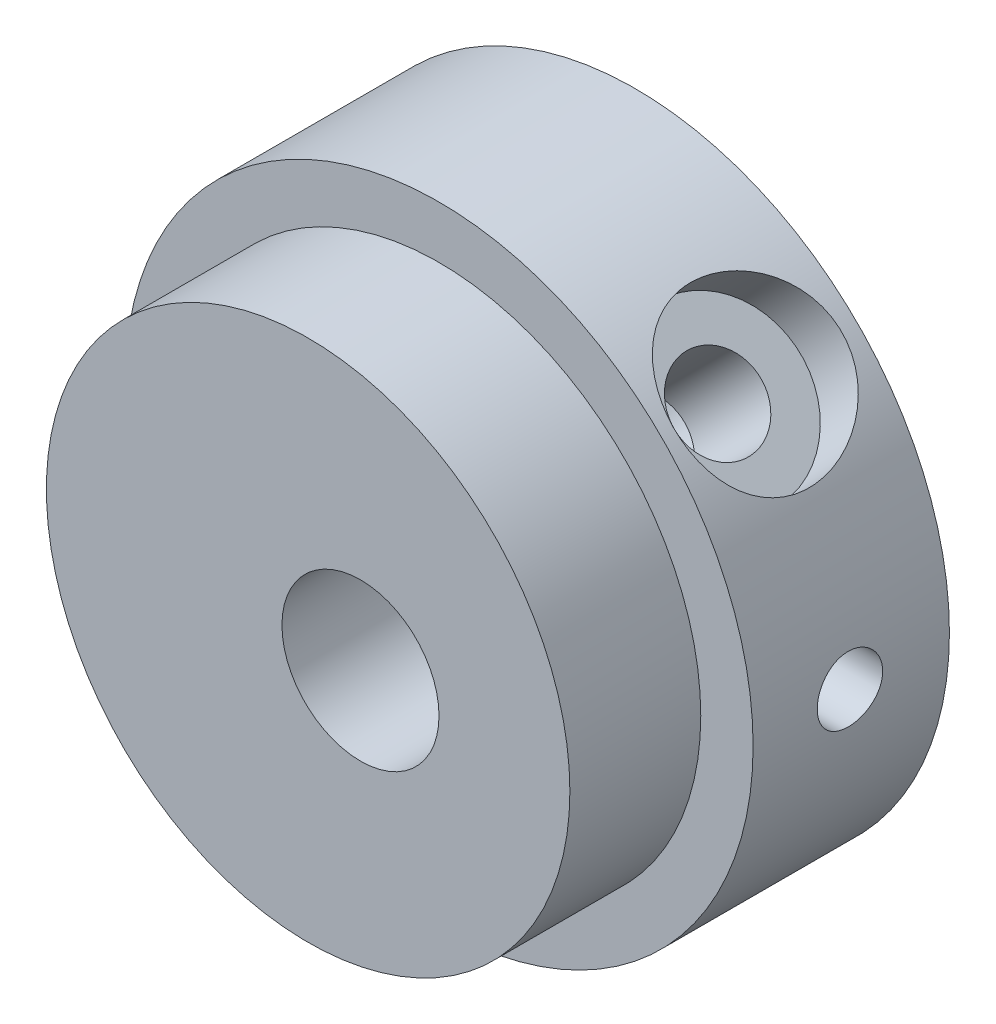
from build123d import *

# Parameters (mm, degrees)
SKETCH1_R                                          = 30.48
BOSS_EXTRUDE1_DEPTH                                = 19.05
SKETCH2_R                                          = 25.4
BOSS_EXTRUDE2_DEPTH                                = 12.7
SKETCH3_R                                          = 7.62
CUT_EXTRUDE1_DEPTH                                 = 47.752
SKETCH4_R                                          = 3.175
CUT_EXTRUDE2_DEPTH                                 = 47.752
CBORE_FOR_5_16_PAN_HEAD_MACHINE_SCREW1_D           = 8.4328
CBORE_FOR_5_16_PAN_HEAD_MACHINE_SCREW1_DEPTH       = 16.002
CBORE_FOR_5_16_PAN_HEAD_MACHINE_SCREW1_CBORE_D     = 16.27124
CBORE_FOR_5_16_PAN_HEAD_MACHINE_SCREW1_CBORE_DEPTH = 5.5372
CBORE_FOR_5_16_PAN_HEAD_MACHINE_SCREW1_TIP         = 2.533468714


with BuildPart() as part:
    # Sketch1 → Boss-Extrude1 (new body)
    with BuildSketch(Plane.XY):
        with Locations(Location((0, 0, 0), (0, 0, 180))):
            Circle(SKETCH1_R)
    extrude(amount=BOSS_EXTRUDE1_DEPTH)

    # Sketch2 → Boss-Extrude2 (add)
    with BuildSketch(Plane.XY.offset(19.05)):
        Circle(SKETCH2_R)
    extrude(amount=BOSS_EXTRUDE2_DEPTH)

    # Sketch3 → Cut-Extrude1 (cut)
    with BuildSketch(Plane(origin=(0, 0, 0), x_dir=(-1, 0, 0), z_dir=(0, 0, -1))):
        with Locations((-5.08, 0)):
            Circle(SKETCH3_R)
    extrude(amount=-CUT_EXTRUDE1_DEPTH, mode=Mode.SUBTRACT)

    # Sketch4 → Cut-Extrude2 (cut)
    with BuildSketch(Plane(origin=(0, 0, 0), x_dir=(0, 0, -1), z_dir=(1, 0, 0))):
        with Locations(Location((-9.652, 0, 0), (0, 0, 180))):
            Circle(SKETCH4_R)
    extrude(amount=CUT_EXTRUDE2_DEPTH, mode=Mode.SUBTRACT)

    # CBORE for 5_16 Pan Head Machine Screw1
    with Locations(Plane(origin=(21.552614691, 21.552614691, 9.652), x_dir=(0.7071067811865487, -0.7071067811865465, 0), z_dir=(0.7071067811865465, 0.7071067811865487, 0))):
        with Locations((0, 0.001350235)):
            CounterBoreHole(CBORE_FOR_5_16_PAN_HEAD_MACHINE_SCREW1_D / 2, CBORE_FOR_5_16_PAN_HEAD_MACHINE_SCREW1_CBORE_D / 2, CBORE_FOR_5_16_PAN_HEAD_MACHINE_SCREW1_CBORE_DEPTH, depth=CBORE_FOR_5_16_PAN_HEAD_MACHINE_SCREW1_DEPTH)
            with Locations((0, 0, -(CBORE_FOR_5_16_PAN_HEAD_MACHINE_SCREW1_DEPTH + CBORE_FOR_5_16_PAN_HEAD_MACHINE_SCREW1_TIP / 2))):  # 118° drill point
                Cone(0, CBORE_FOR_5_16_PAN_HEAD_MACHINE_SCREW1_D / 2, CBORE_FOR_5_16_PAN_HEAD_MACHINE_SCREW1_TIP, mode=Mode.SUBTRACT)


solid = part.part
